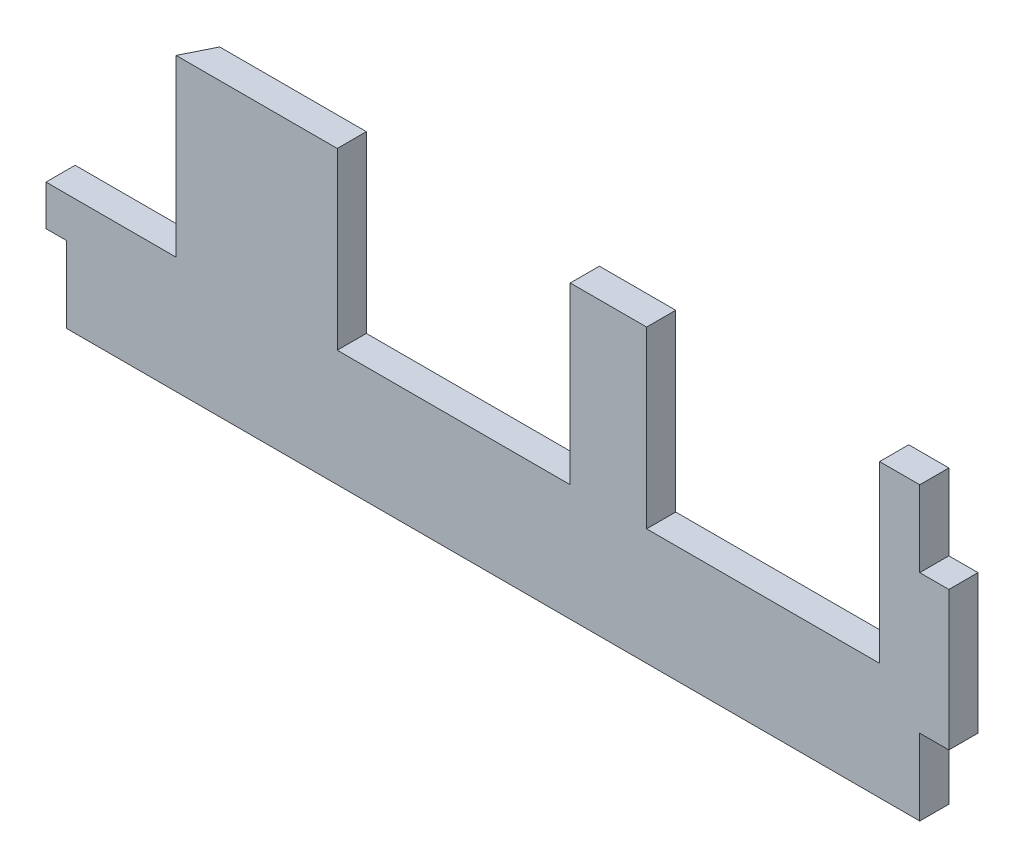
ISO-10303-21;
HEADER;
FILE_DESCRIPTION(('STEP AP214'),'2;1');
FILE_NAME('part.step','',(''),(''),'','','');
FILE_SCHEMA(('AUTOMOTIVE_DESIGN { 1 0 10303 214 1 1 1 1 }'));
ENDSEC;
DATA;
#1=APPLICATION_CONTEXT('core data for automotive mechanical design processes');
#2=APPLICATION_PROTOCOL_DEFINITION('international standard','automotive_design',2000,#1);
#3=PRODUCT_CONTEXT('',#1,'mechanical');
#4=PRODUCT('Part','Part','',(#3));
#5=PRODUCT_RELATED_PRODUCT_CATEGORY('part','',(#4));
#6=PRODUCT_DEFINITION_FORMATION('','',#4);
#7=PRODUCT_DEFINITION_CONTEXT('part definition',#1,'design');
#8=PRODUCT_DEFINITION('design','',#6,#7);
#9=PRODUCT_DEFINITION_SHAPE('','',#8);
#10=(LENGTH_UNIT() NAMED_UNIT(*) SI_UNIT(.MILLI.,.METRE.));
#11=(NAMED_UNIT(*) PLANE_ANGLE_UNIT() SI_UNIT($,.RADIAN.));
#12=(NAMED_UNIT(*) SI_UNIT($,.STERADIAN.) SOLID_ANGLE_UNIT());
#13=UNCERTAINTY_MEASURE_WITH_UNIT(LENGTH_MEASURE(1.E-05),#10,'distance_accuracy_value','');
#14=(GEOMETRIC_REPRESENTATION_CONTEXT(3) GLOBAL_UNCERTAINTY_ASSIGNED_CONTEXT((#13)) GLOBAL_UNIT_ASSIGNED_CONTEXT((#10,
#11,#12)) REPRESENTATION_CONTEXT('',''));
#15=CARTESIAN_POINT('',(0.,0.,0.));
#16=DIRECTION('',(0.,0.,1.));
#17=DIRECTION('',(1.,0.,0.));
#18=AXIS2_PLACEMENT_3D('',#15,#16,#17);
#19=CARTESIAN_POINT('',(-409.754754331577,131.379168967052,-12.7));
#20=DIRECTION('',(-1.,0.,0.));
#21=DIRECTION('',(0.,0.,1.));
#22=AXIS2_PLACEMENT_3D('',#19,#20,#21);
#23=PLANE('',#22);
#24=DIRECTION('',(0.,-1.,0.));
#25=VECTOR('',#24,1.);
#26=CARTESIAN_POINT('',(-409.754754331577,131.379168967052,0.));
#27=LINE('',#26,#25);
#28=CARTESIAN_POINT('',(-409.754754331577,148.988624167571,0.));
#29=VERTEX_POINT('',#28);
#30=CARTESIAN_POINT('',(-409.754754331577,131.379168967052,0.));
#31=VERTEX_POINT('',#30);
#32=EDGE_CURVE('E183',#29,#31,#27,.T.);
#33=ORIENTED_EDGE('',*,*,#32,.F.);
#34=DIRECTION('',(0.,0.,1.));
#35=VECTOR('',#34,1.);
#36=CARTESIAN_POINT('',(-409.754754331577,148.988624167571,-12.7));
#37=LINE('',#36,#35);
#38=CARTESIAN_POINT('',(-409.754754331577,148.988624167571,-12.7));
#39=VERTEX_POINT('',#38);
#40=EDGE_CURVE('E48',#39,#29,#37,.T.);
#41=ORIENTED_EDGE('',*,*,#40,.F.);
#42=DIRECTION('',(0.,-1.,0.));
#43=VECTOR('',#42,1.);
#44=CARTESIAN_POINT('',(-409.754754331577,131.379168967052,-12.7));
#45=LINE('',#44,#43);
#46=CARTESIAN_POINT('',(-409.754754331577,131.379168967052,-12.7));
#47=VERTEX_POINT('',#46);
#48=EDGE_CURVE('E181',#39,#47,#45,.T.);
#49=ORIENTED_EDGE('',*,*,#48,.T.);
#50=DIRECTION('',(0.,0.,1.));
#51=VECTOR('',#50,1.);
#52=CARTESIAN_POINT('',(-409.754754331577,131.379168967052,-12.7));
#53=LINE('',#52,#51);
#54=EDGE_CURVE('E246',#47,#31,#53,.T.);
#55=ORIENTED_EDGE('',*,*,#54,.T.);
#56=EDGE_LOOP('',(#33,#41,#49,#55));
#57=FACE_BOUND('',#56,.T.);
#58=ADVANCED_FACE('F31',(#57),#23,.T.);
#59=CARTESIAN_POINT('',(-409.754754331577,225.188624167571,-12.7));
#60=DIRECTION('',(0.,1.,0.));
#61=DIRECTION('',(-1.,0.,0.));
#62=AXIS2_PLACEMENT_3D('',#59,#60,#61);
#63=PLANE('',#62);
#64=DIRECTION('',(0.,0.,1.));
#65=VECTOR('',#64,1.);
#66=CARTESIAN_POINT('',(-147.863985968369,225.18862416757,-12.7));
#67=LINE('',#66,#65);
#68=CARTESIAN_POINT('',(-147.863985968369,225.18862416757,-12.7));
#69=VERTEX_POINT('',#68);
#70=CARTESIAN_POINT('',(-147.863985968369,225.18862416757,0.));
#71=VERTEX_POINT('',#70);
#72=EDGE_CURVE('E298',#69,#71,#67,.T.);
#73=ORIENTED_EDGE('',*,*,#72,.F.);
#74=DIRECTION('',(-1.,0.,0.));
#75=VECTOR('',#74,1.);
#76=CARTESIAN_POINT('',(-409.754754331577,225.188624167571,-12.7));
#77=LINE('',#76,#75);
#78=CARTESIAN_POINT('',(-181.154754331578,225.18862416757,-12.7));
#79=VERTEX_POINT('',#78);
#80=EDGE_CURVE('E196',#69,#79,#77,.T.);
#81=ORIENTED_EDGE('',*,*,#80,.T.);
#82=DIRECTION('',(0.,0.,-1.));
#83=VECTOR('',#82,1.);
#84=CARTESIAN_POINT('',(-181.154754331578,225.18862416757,-12.7));
#85=LINE('',#84,#83);
#86=CARTESIAN_POINT('',(-181.154754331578,225.18862416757,0.));
#87=VERTEX_POINT('',#86);
#88=EDGE_CURVE('E297',#87,#79,#85,.T.);
#89=ORIENTED_EDGE('',*,*,#88,.F.);
#90=DIRECTION('',(-1.,0.,0.));
#91=VECTOR('',#90,1.);
#92=CARTESIAN_POINT('',(-409.754754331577,225.188624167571,0.));
#93=LINE('',#92,#91);
#94=EDGE_CURVE('E226',#71,#87,#93,.T.);
#95=ORIENTED_EDGE('',*,*,#94,.F.);
#96=EDGE_LOOP('',(#73,#81,#89,#95));
#97=FACE_BOUND('',#96,.T.);
#98=ADVANCED_FACE('F295',(#97),#63,.T.);
#99=DIRECTION('',(0.44510351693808,0.,-0.895479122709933));
#100=VECTOR('',#99,1.);
#101=CARTESIAN_POINT('',(-353.025346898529,225.188624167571,0.));
#102=LINE('',#101,#100);
#103=CARTESIAN_POINT('',(-353.025346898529,225.188624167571,0.));
#104=VERTEX_POINT('',#103);
#105=CARTESIAN_POINT('',(-346.712732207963,225.188624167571,-12.7));
#106=VERTEX_POINT('',#105);
#107=EDGE_CURVE('E176',#104,#106,#102,.T.);
#108=ORIENTED_EDGE('',*,*,#107,.F.);
#109=CARTESIAN_POINT('',(-282.754754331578,225.188624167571,0.));
#110=VERTEX_POINT('',#109);
#111=EDGE_CURVE('E222',#110,#104,#93,.T.);
#112=ORIENTED_EDGE('',*,*,#111,.F.);
#113=DIRECTION('',(0.,0.,1.));
#114=VECTOR('',#113,1.);
#115=CARTESIAN_POINT('',(-282.754754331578,225.188624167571,-12.7));
#116=LINE('',#115,#114);
#117=CARTESIAN_POINT('',(-282.754754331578,225.188624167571,-12.7));
#118=VERTEX_POINT('',#117);
#119=EDGE_CURVE('E309',#118,#110,#116,.T.);
#120=ORIENTED_EDGE('',*,*,#119,.F.);
#121=EDGE_CURVE('E198',#118,#106,#77,.T.);
#122=ORIENTED_EDGE('',*,*,#121,.T.);
#123=EDGE_LOOP('',(#108,#112,#120,#122));
#124=FACE_BOUND('',#123,.T.);
#125=ADVANCED_FACE('F389',(#124),#63,.T.);
#126=CARTESIAN_POINT('',(-16.0547543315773,131.379168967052,-12.7));
#127=DIRECTION('',(0.,-1.,0.));
#128=DIRECTION('',(0.,0.,-1.));
#129=AXIS2_PLACEMENT_3D('',#126,#127,#128);
#130=PLANE('',#129);
#131=DIRECTION('',(1.,0.,0.));
#132=VECTOR('',#131,1.);
#133=CARTESIAN_POINT('',(-16.0547543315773,131.379168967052,0.));
#134=LINE('',#133,#132);
#135=CARTESIAN_POINT('',(-28.7547543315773,131.379168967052,0.));
#136=VERTEX_POINT('',#135);
#137=CARTESIAN_POINT('',(-16.0547543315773,131.379168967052,0.));
#138=VERTEX_POINT('',#137);
#139=EDGE_CURVE('E209',#136,#138,#134,.T.);
#140=ORIENTED_EDGE('',*,*,#139,.F.);
#141=DIRECTION('',(0.,0.,1.));
#142=VECTOR('',#141,1.);
#143=CARTESIAN_POINT('',(-28.7547543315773,131.379168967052,-12.7));
#144=LINE('',#143,#142);
#145=CARTESIAN_POINT('',(-28.7547543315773,131.379168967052,-12.7));
#146=VERTEX_POINT('',#145);
#147=EDGE_CURVE('E11',#146,#136,#144,.T.);
#148=ORIENTED_EDGE('',*,*,#147,.F.);
#149=DIRECTION('',(1.,0.,0.));
#150=VECTOR('',#149,1.);
#151=CARTESIAN_POINT('',(-16.0547543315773,131.379168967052,-12.7));
#152=LINE('',#151,#150);
#153=CARTESIAN_POINT('',(-16.0547543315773,131.379168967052,-12.7));
#154=VERTEX_POINT('',#153);
#155=EDGE_CURVE('E239',#146,#154,#152,.T.);
#156=ORIENTED_EDGE('',*,*,#155,.T.);
#157=DIRECTION('',(0.,0.,1.));
#158=VECTOR('',#157,1.);
#159=CARTESIAN_POINT('',(-16.0547543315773,131.379168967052,-12.7));
#160=LINE('',#159,#158);
#161=EDGE_CURVE('E35',#154,#138,#160,.T.);
#162=ORIENTED_EDGE('',*,*,#161,.T.);
#163=EDGE_LOOP('',(#140,#148,#156,#162));
#164=FACE_BOUND('',#163,.T.);
#165=ADVANCED_FACE('F33',(#164),#130,.T.);
#166=CARTESIAN_POINT('',(-28.7547543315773,131.379168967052,-12.7));
#167=DIRECTION('',(1.,0.,0.));
#168=DIRECTION('',(0.,0.,-1.));
#169=AXIS2_PLACEMENT_3D('',#166,#167,#168);
#170=PLANE('',#169);
#171=DIRECTION('',(0.,1.,0.));
#172=VECTOR('',#171,1.);
#173=CARTESIAN_POINT('',(-28.7547543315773,131.379168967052,0.));
#174=LINE('',#173,#172);
#175=CARTESIAN_POINT('',(-28.7547543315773,98.1886241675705,0.));
#176=VERTEX_POINT('',#175);
#177=EDGE_CURVE('E237',#176,#136,#174,.T.);
#178=ORIENTED_EDGE('',*,*,#177,.F.);
#179=DIRECTION('',(0.,0.,1.));
#180=VECTOR('',#179,1.);
#181=CARTESIAN_POINT('',(-28.7547543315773,98.1886241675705,-12.7));
#182=LINE('',#181,#180);
#183=CARTESIAN_POINT('',(-28.7547543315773,98.1886241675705,-12.7));
#184=VERTEX_POINT('',#183);
#185=EDGE_CURVE('E40',#184,#176,#182,.T.);
#186=ORIENTED_EDGE('',*,*,#185,.F.);
#187=DIRECTION('',(0.,1.,0.));
#188=VECTOR('',#187,1.);
#189=CARTESIAN_POINT('',(-28.7547543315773,131.379168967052,-12.7));
#190=LINE('',#189,#188);
#191=EDGE_CURVE('E206',#184,#146,#190,.T.);
#192=ORIENTED_EDGE('',*,*,#191,.T.);
#193=ORIENTED_EDGE('',*,*,#147,.T.);
#194=EDGE_LOOP('',(#178,#186,#192,#193));
#195=FACE_BOUND('',#194,.T.);
#196=ADVANCED_FACE('F268',(#195),#170,.T.);
#197=CARTESIAN_POINT('',(-400.774498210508,98.1886241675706,-12.7));
#198=DIRECTION('',(0.,-1.,0.));
#199=DIRECTION('',(1.,0.,0.));
#200=AXIS2_PLACEMENT_3D('',#197,#198,#199);
#201=PLANE('',#200);
#202=DIRECTION('',(1.,0.,0.));
#203=VECTOR('',#202,1.);
#204=CARTESIAN_POINT('',(-400.774498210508,98.1886241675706,0.));
#205=LINE('',#204,#203);
#206=CARTESIAN_POINT('',(-400.774498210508,98.1886241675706,0.));
#207=VERTEX_POINT('',#206);
#208=EDGE_CURVE('E234',#207,#176,#205,.T.);
#209=ORIENTED_EDGE('',*,*,#208,.F.);
#210=DIRECTION('',(0.,0.,1.));
#211=VECTOR('',#210,1.);
#212=CARTESIAN_POINT('',(-400.774498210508,98.1886241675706,-12.7));
#213=LINE('',#212,#211);
#214=CARTESIAN_POINT('',(-400.774498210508,98.1886241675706,-12.7));
#215=VERTEX_POINT('',#214);
#216=EDGE_CURVE('E242',#215,#207,#213,.T.);
#217=ORIENTED_EDGE('',*,*,#216,.F.);
#218=DIRECTION('',(1.,0.,0.));
#219=VECTOR('',#218,1.);
#220=CARTESIAN_POINT('',(-400.774498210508,98.1886241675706,-12.7));
#221=LINE('',#220,#219);
#222=EDGE_CURVE('E203',#215,#184,#221,.T.);
#223=ORIENTED_EDGE('',*,*,#222,.T.);
#224=ORIENTED_EDGE('',*,*,#185,.T.);
#225=EDGE_LOOP('',(#209,#217,#223,#224));
#226=FACE_BOUND('',#225,.T.);
#227=ADVANCED_FACE('F426',(#226),#201,.T.);
#228=CARTESIAN_POINT('',(-400.774498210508,98.1886241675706,-12.7));
#229=DIRECTION('',(-1.,0.,0.));
#230=DIRECTION('',(0.,0.,1.));
#231=AXIS2_PLACEMENT_3D('',#228,#229,#230);
#232=PLANE('',#231);
#233=DIRECTION('',(0.,-1.,0.));
#234=VECTOR('',#233,1.);
#235=CARTESIAN_POINT('',(-400.774498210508,98.1886241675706,0.));
#236=LINE('',#235,#234);
#237=CARTESIAN_POINT('',(-400.774498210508,131.379168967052,0.));
#238=VERTEX_POINT('',#237);
#239=EDGE_CURVE('E231',#238,#207,#236,.T.);
#240=ORIENTED_EDGE('',*,*,#239,.F.);
#241=DIRECTION('',(0.,0.,1.));
#242=VECTOR('',#241,1.);
#243=CARTESIAN_POINT('',(-400.774498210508,131.379168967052,-12.7));
#244=LINE('',#243,#242);
#245=CARTESIAN_POINT('',(-400.774498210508,131.379168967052,-12.7));
#246=VERTEX_POINT('',#245);
#247=EDGE_CURVE('E244',#246,#238,#244,.T.);
#248=ORIENTED_EDGE('',*,*,#247,.F.);
#249=DIRECTION('',(0.,-1.,0.));
#250=VECTOR('',#249,1.);
#251=CARTESIAN_POINT('',(-400.774498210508,98.1886241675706,-12.7));
#252=LINE('',#251,#250);
#253=EDGE_CURVE('E193',#246,#215,#252,.T.);
#254=ORIENTED_EDGE('',*,*,#253,.T.);
#255=ORIENTED_EDGE('',*,*,#216,.T.);
#256=EDGE_LOOP('',(#240,#248,#254,#255));
#257=FACE_BOUND('',#256,.T.);
#258=ADVANCED_FACE('F398',(#257),#232,.T.);
#259=CARTESIAN_POINT('',(-400.774498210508,131.379168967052,-12.7));
#260=DIRECTION('',(0.,-1.,0.));
#261=DIRECTION('',(0.,0.,-1.));
#262=AXIS2_PLACEMENT_3D('',#259,#260,#261);
#263=PLANE('',#262);
#264=DIRECTION('',(1.,0.,0.));
#265=VECTOR('',#264,1.);
#266=CARTESIAN_POINT('',(-400.774498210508,131.379168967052,0.));
#267=LINE('',#266,#265);
#268=EDGE_CURVE('E228',#31,#238,#267,.T.);
#269=ORIENTED_EDGE('',*,*,#268,.F.);
#270=ORIENTED_EDGE('',*,*,#54,.F.);
#271=DIRECTION('',(1.,0.,0.));
#272=VECTOR('',#271,1.);
#273=CARTESIAN_POINT('',(-400.774498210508,131.379168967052,-12.7));
#274=LINE('',#273,#272);
#275=EDGE_CURVE('E190',#47,#246,#274,.T.);
#276=ORIENTED_EDGE('',*,*,#275,.T.);
#277=ORIENTED_EDGE('',*,*,#247,.T.);
#278=EDGE_LOOP('',(#269,#270,#276,#277));
#279=FACE_BOUND('',#278,.T.);
#280=ADVANCED_FACE('F392',(#279),#263,.T.);
#281=DIRECTION('',(0.,0.,-1.));
#282=VECTOR('',#281,1.);
#283=CARTESIAN_POINT('',(-46.2639859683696,225.18862416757,-12.7));
#284=LINE('',#283,#282);
#285=CARTESIAN_POINT('',(-46.2639859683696,225.18862416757,0.));
#286=VERTEX_POINT('',#285);
#287=CARTESIAN_POINT('',(-46.2639859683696,225.18862416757,-12.7));
#288=VERTEX_POINT('',#287);
#289=EDGE_CURVE('E337',#286,#288,#284,.T.);
#290=ORIENTED_EDGE('',*,*,#289,.F.);
#291=CARTESIAN_POINT('',(-28.7547543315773,225.18862416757,0.));
#292=VERTEX_POINT('',#291);
#293=EDGE_CURVE('E223',#292,#286,#93,.T.);
#294=ORIENTED_EDGE('',*,*,#293,.F.);
#295=DIRECTION('',(0.,0.,1.));
#296=VECTOR('',#295,1.);
#297=CARTESIAN_POINT('',(-28.7547543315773,225.18862416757,-12.7));
#298=LINE('',#297,#296);
#299=CARTESIAN_POINT('',(-28.7547543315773,225.18862416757,-12.7));
#300=VERTEX_POINT('',#299);
#301=EDGE_CURVE('E248',#300,#292,#298,.T.);
#302=ORIENTED_EDGE('',*,*,#301,.F.);
#303=EDGE_CURVE('E191',#300,#288,#77,.T.);
#304=ORIENTED_EDGE('',*,*,#303,.T.);
#305=EDGE_LOOP('',(#290,#294,#302,#304));
#306=FACE_BOUND('',#305,.T.);
#307=ADVANCED_FACE('F372',(#306),#63,.T.);
#308=CARTESIAN_POINT('',(-28.7547543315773,225.18862416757,-12.7));
#309=DIRECTION('',(1.,0.,0.));
#310=DIRECTION('',(0.,0.,-1.));
#311=AXIS2_PLACEMENT_3D('',#308,#309,#310);
#312=PLANE('',#311);
#313=DIRECTION('',(0.,1.,0.));
#314=VECTOR('',#313,1.);
#315=CARTESIAN_POINT('',(-28.7547543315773,225.18862416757,0.));
#316=LINE('',#315,#314);
#317=CARTESIAN_POINT('',(-28.7547543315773,191.998079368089,0.));
#318=VERTEX_POINT('',#317);
#319=EDGE_CURVE('E219',#318,#292,#316,.T.);
#320=ORIENTED_EDGE('',*,*,#319,.F.);
#321=DIRECTION('',(0.,0.,1.));
#322=VECTOR('',#321,1.);
#323=CARTESIAN_POINT('',(-28.7547543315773,191.998079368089,-12.7));
#324=LINE('',#323,#322);
#325=CARTESIAN_POINT('',(-28.7547543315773,191.998079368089,-12.7));
#326=VERTEX_POINT('',#325);
#327=EDGE_CURVE('E250',#326,#318,#324,.T.);
#328=ORIENTED_EDGE('',*,*,#327,.F.);
#329=DIRECTION('',(0.,1.,0.));
#330=VECTOR('',#329,1.);
#331=CARTESIAN_POINT('',(-28.7547543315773,225.18862416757,-12.7));
#332=LINE('',#331,#330);
#333=EDGE_CURVE('E281',#326,#300,#332,.T.);
#334=ORIENTED_EDGE('',*,*,#333,.T.);
#335=ORIENTED_EDGE('',*,*,#301,.T.);
#336=EDGE_LOOP('',(#320,#328,#334,#335));
#337=FACE_BOUND('',#336,.T.);
#338=ADVANCED_FACE('F374',(#337),#312,.T.);
#339=CARTESIAN_POINT('',(-16.0547543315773,191.998079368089,-12.7));
#340=DIRECTION('',(0.,1.,0.));
#341=DIRECTION('',(0.,0.,1.));
#342=AXIS2_PLACEMENT_3D('',#339,#340,#341);
#343=PLANE('',#342);
#344=DIRECTION('',(-1.,0.,0.));
#345=VECTOR('',#344,1.);
#346=CARTESIAN_POINT('',(-16.0547543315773,191.998079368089,0.));
#347=LINE('',#346,#345);
#348=CARTESIAN_POINT('',(-16.0547543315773,191.998079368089,0.));
#349=VERTEX_POINT('',#348);
#350=EDGE_CURVE('E216',#349,#318,#347,.T.);
#351=ORIENTED_EDGE('',*,*,#350,.F.);
#352=DIRECTION('',(0.,0.,1.));
#353=VECTOR('',#352,1.);
#354=CARTESIAN_POINT('',(-16.0547543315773,191.998079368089,-12.7));
#355=LINE('',#354,#353);
#356=CARTESIAN_POINT('',(-16.0547543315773,191.998079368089,-12.7));
#357=VERTEX_POINT('',#356);
#358=EDGE_CURVE('E251',#357,#349,#355,.T.);
#359=ORIENTED_EDGE('',*,*,#358,.F.);
#360=DIRECTION('',(-1.,0.,0.));
#361=VECTOR('',#360,1.);
#362=CARTESIAN_POINT('',(-16.0547543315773,191.998079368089,-12.7));
#363=LINE('',#362,#361);
#364=EDGE_CURVE('E274',#357,#326,#363,.T.);
#365=ORIENTED_EDGE('',*,*,#364,.T.);
#366=ORIENTED_EDGE('',*,*,#327,.T.);
#367=EDGE_LOOP('',(#351,#359,#365,#366));
#368=FACE_BOUND('',#367,.T.);
#369=ADVANCED_FACE('F376',(#368),#343,.T.);
#370=CARTESIAN_POINT('',(-16.0547543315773,191.998079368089,-12.7));
#371=DIRECTION('',(1.,0.,0.));
#372=DIRECTION('',(0.,0.,-1.));
#373=AXIS2_PLACEMENT_3D('',#370,#371,#372);
#374=PLANE('',#373);
#375=DIRECTION('',(0.,1.,0.));
#376=VECTOR('',#375,1.);
#377=CARTESIAN_POINT('',(-16.0547543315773,191.998079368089,0.));
#378=LINE('',#377,#376);
#379=EDGE_CURVE('E212',#138,#349,#378,.T.);
#380=ORIENTED_EDGE('',*,*,#379,.F.);
#381=ORIENTED_EDGE('',*,*,#161,.F.);
#382=DIRECTION('',(0.,1.,0.));
#383=VECTOR('',#382,1.);
#384=CARTESIAN_POINT('',(-16.0547543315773,191.998079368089,-12.7));
#385=LINE('',#384,#383);
#386=EDGE_CURVE('E272',#154,#357,#385,.T.);
#387=ORIENTED_EDGE('',*,*,#386,.T.);
#388=ORIENTED_EDGE('',*,*,#358,.T.);
#389=EDGE_LOOP('',(#380,#381,#387,#388));
#390=FACE_BOUND('',#389,.T.);
#391=ADVANCED_FACE('F261',(#390),#374,.T.);
#392=CARTESIAN_POINT('',(-28.7547543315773,131.379168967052,-12.7));
#393=DIRECTION('',(0.,0.,1.));
#394=DIRECTION('',(1.,0.,0.));
#395=AXIS2_PLACEMENT_3D('',#392,#393,#394);
#396=PLANE('',#395);
#397=DIRECTION('',(-1.,0.,0.));
#398=VECTOR('',#397,1.);
#399=CARTESIAN_POINT('',(-346.712732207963,148.988624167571,-12.7));
#400=LINE('',#399,#398);
#401=CARTESIAN_POINT('',(-346.712732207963,148.988624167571,-12.7));
#402=VERTEX_POINT('',#401);
#403=EDGE_CURVE('E169',#402,#39,#400,.T.);
#404=ORIENTED_EDGE('',*,*,#403,.F.);
#405=DIRECTION('',(0.,1.,0.));
#406=VECTOR('',#405,1.);
#407=CARTESIAN_POINT('',(-346.712732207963,148.988624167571,-12.7));
#408=LINE('',#407,#406);
#409=EDGE_CURVE('E340',#402,#106,#408,.T.);
#410=ORIENTED_EDGE('',*,*,#409,.T.);
#411=ORIENTED_EDGE('',*,*,#121,.F.);
#412=DIRECTION('',(0.,1.,0.));
#413=VECTOR('',#412,1.);
#414=CARTESIAN_POINT('',(-282.754754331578,148.988624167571,-12.7));
#415=LINE('',#414,#413);
#416=CARTESIAN_POINT('',(-282.754754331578,148.988624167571,-12.7));
#417=VERTEX_POINT('',#416);
#418=EDGE_CURVE('E213',#417,#118,#415,.T.);
#419=ORIENTED_EDGE('',*,*,#418,.F.);
#420=DIRECTION('',(-1.,0.,0.));
#421=VECTOR('',#420,1.);
#422=CARTESIAN_POINT('',(-282.754754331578,148.988624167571,-12.7));
#423=LINE('',#422,#421);
#424=CARTESIAN_POINT('',(-181.154754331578,148.98862416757,-12.7));
#425=VERTEX_POINT('',#424);
#426=EDGE_CURVE('E314',#425,#417,#423,.T.);
#427=ORIENTED_EDGE('',*,*,#426,.F.);
#428=DIRECTION('',(0.,1.,0.));
#429=VECTOR('',#428,1.);
#430=CARTESIAN_POINT('',(-181.154754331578,148.98862416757,-12.7));
#431=LINE('',#430,#429);
#432=EDGE_CURVE('E304',#425,#79,#431,.T.);
#433=ORIENTED_EDGE('',*,*,#432,.T.);
#434=ORIENTED_EDGE('',*,*,#80,.F.);
#435=DIRECTION('',(0.,1.,0.));
#436=VECTOR('',#435,1.);
#437=CARTESIAN_POINT('',(-147.863985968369,148.98862416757,-12.7));
#438=LINE('',#437,#436);
#439=CARTESIAN_POINT('',(-147.863985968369,148.98862416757,-12.7));
#440=VERTEX_POINT('',#439);
#441=EDGE_CURVE('E319',#440,#69,#438,.T.);
#442=ORIENTED_EDGE('',*,*,#441,.F.);
#443=DIRECTION('',(-1.,0.,0.));
#444=VECTOR('',#443,1.);
#445=CARTESIAN_POINT('',(-147.863985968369,148.98862416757,-12.7));
#446=LINE('',#445,#444);
#447=CARTESIAN_POINT('',(-46.2639859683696,148.98862416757,-12.7));
#448=VERTEX_POINT('',#447);
#449=EDGE_CURVE('E331',#448,#440,#446,.T.);
#450=ORIENTED_EDGE('',*,*,#449,.F.);
#451=DIRECTION('',(0.,1.,0.));
#452=VECTOR('',#451,1.);
#453=CARTESIAN_POINT('',(-46.2639859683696,148.98862416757,-12.7));
#454=LINE('',#453,#452);
#455=EDGE_CURVE('E333',#448,#288,#454,.T.);
#456=ORIENTED_EDGE('',*,*,#455,.T.);
#457=ORIENTED_EDGE('',*,*,#303,.F.);
#458=ORIENTED_EDGE('',*,*,#333,.F.);
#459=ORIENTED_EDGE('',*,*,#364,.F.);
#460=ORIENTED_EDGE('',*,*,#386,.F.);
#461=ORIENTED_EDGE('',*,*,#155,.F.);
#462=ORIENTED_EDGE('',*,*,#191,.F.);
#463=ORIENTED_EDGE('',*,*,#222,.F.);
#464=ORIENTED_EDGE('',*,*,#253,.F.);
#465=ORIENTED_EDGE('',*,*,#275,.F.);
#466=ORIENTED_EDGE('',*,*,#48,.F.);
#467=EDGE_LOOP('',(#404,#410,#411,#419,#427,#433,#434,#442,#450,#456,#457,#458,#459,#460,#461,
#462,#463,#464,#465,#466));
#468=FACE_BOUND('',#467,.T.);
#469=ADVANCED_FACE('F187',(#468),#396,.F.);
#470=CARTESIAN_POINT('',(-28.7547543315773,131.379168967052,0.));
#471=DIRECTION('',(0.,0.,1.));
#472=DIRECTION('',(1.,0.,0.));
#473=AXIS2_PLACEMENT_3D('',#470,#471,#472);
#474=PLANE('',#473);
#475=DIRECTION('',(0.,1.,0.));
#476=VECTOR('',#475,1.);
#477=CARTESIAN_POINT('',(-353.025346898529,148.988624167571,0.));
#478=LINE('',#477,#476);
#479=CARTESIAN_POINT('',(-353.025346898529,148.988624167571,0.));
#480=VERTEX_POINT('',#479);
#481=EDGE_CURVE('E348',#480,#104,#478,.T.);
#482=ORIENTED_EDGE('',*,*,#481,.F.);
#483=DIRECTION('',(1.,0.,0.));
#484=VECTOR('',#483,1.);
#485=CARTESIAN_POINT('',(-409.754754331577,148.988624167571,0.));
#486=LINE('',#485,#484);
#487=EDGE_CURVE('E184',#29,#480,#486,.T.);
#488=ORIENTED_EDGE('',*,*,#487,.F.);
#489=ORIENTED_EDGE('',*,*,#32,.T.);
#490=ORIENTED_EDGE('',*,*,#268,.T.);
#491=ORIENTED_EDGE('',*,*,#239,.T.);
#492=ORIENTED_EDGE('',*,*,#208,.T.);
#493=ORIENTED_EDGE('',*,*,#177,.T.);
#494=ORIENTED_EDGE('',*,*,#139,.T.);
#495=ORIENTED_EDGE('',*,*,#379,.T.);
#496=ORIENTED_EDGE('',*,*,#350,.T.);
#497=ORIENTED_EDGE('',*,*,#319,.T.);
#498=ORIENTED_EDGE('',*,*,#293,.T.);
#499=DIRECTION('',(0.,1.,0.));
#500=VECTOR('',#499,1.);
#501=CARTESIAN_POINT('',(-46.2639859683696,148.98862416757,0.));
#502=LINE('',#501,#500);
#503=CARTESIAN_POINT('',(-46.2639859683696,148.98862416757,0.));
#504=VERTEX_POINT('',#503);
#505=EDGE_CURVE('E330',#504,#286,#502,.T.);
#506=ORIENTED_EDGE('',*,*,#505,.F.);
#507=DIRECTION('',(1.,0.,0.));
#508=VECTOR('',#507,1.);
#509=CARTESIAN_POINT('',(-147.863985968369,148.98862416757,0.));
#510=LINE('',#509,#508);
#511=CARTESIAN_POINT('',(-147.863985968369,148.98862416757,0.));
#512=VERTEX_POINT('',#511);
#513=EDGE_CURVE('E345',#512,#504,#510,.T.);
#514=ORIENTED_EDGE('',*,*,#513,.F.);
#515=DIRECTION('',(0.,1.,0.));
#516=VECTOR('',#515,1.);
#517=CARTESIAN_POINT('',(-147.863985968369,148.98862416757,0.));
#518=LINE('',#517,#516);
#519=EDGE_CURVE('E327',#512,#71,#518,.T.);
#520=ORIENTED_EDGE('',*,*,#519,.T.);
#521=ORIENTED_EDGE('',*,*,#94,.T.);
#522=DIRECTION('',(0.,1.,0.));
#523=VECTOR('',#522,1.);
#524=CARTESIAN_POINT('',(-181.154754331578,148.98862416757,0.));
#525=LINE('',#524,#523);
#526=CARTESIAN_POINT('',(-181.154754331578,148.98862416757,0.));
#527=VERTEX_POINT('',#526);
#528=EDGE_CURVE('E307',#527,#87,#525,.T.);
#529=ORIENTED_EDGE('',*,*,#528,.F.);
#530=DIRECTION('',(1.,0.,0.));
#531=VECTOR('',#530,1.);
#532=CARTESIAN_POINT('',(-282.754754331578,148.988624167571,0.));
#533=LINE('',#532,#531);
#534=CARTESIAN_POINT('',(-282.754754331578,148.988624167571,0.));
#535=VERTEX_POINT('',#534);
#536=EDGE_CURVE('E323',#535,#527,#533,.T.);
#537=ORIENTED_EDGE('',*,*,#536,.F.);
#538=DIRECTION('',(0.,1.,0.));
#539=VECTOR('',#538,1.);
#540=CARTESIAN_POINT('',(-282.754754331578,148.988624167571,0.));
#541=LINE('',#540,#539);
#542=EDGE_CURVE('E277',#535,#110,#541,.T.);
#543=ORIENTED_EDGE('',*,*,#542,.T.);
#544=ORIENTED_EDGE('',*,*,#111,.T.);
#545=EDGE_LOOP('',(#482,#488,#489,#490,#491,#492,#493,#494,#495,#496,#497,#498,#506,#514,#520,
#521,#529,#537,#543,#544));
#546=FACE_BOUND('',#545,.T.);
#547=ADVANCED_FACE('F264',(#546),#474,.T.);
#548=CARTESIAN_POINT('',(-282.754754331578,148.988624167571,-12.7));
#549=DIRECTION('',(-1.,0.,0.));
#550=DIRECTION('',(0.,-1.,0.));
#551=AXIS2_PLACEMENT_3D('',#548,#549,#550);
#552=PLANE('',#551);
#553=ORIENTED_EDGE('',*,*,#119,.T.);
#554=ORIENTED_EDGE('',*,*,#542,.F.);
#555=DIRECTION('',(0.,0.,1.));
#556=VECTOR('',#555,1.);
#557=CARTESIAN_POINT('',(-282.754754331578,148.988624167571,-12.7));
#558=LINE('',#557,#556);
#559=EDGE_CURVE('E308',#417,#535,#558,.T.);
#560=ORIENTED_EDGE('',*,*,#559,.F.);
#561=ORIENTED_EDGE('',*,*,#418,.T.);
#562=EDGE_LOOP('',(#553,#554,#560,#561));
#563=FACE_BOUND('',#562,.T.);
#564=ADVANCED_FACE('F405',(#563),#552,.F.);
#565=CARTESIAN_POINT('',(-181.154754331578,148.98862416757,-12.7));
#566=DIRECTION('',(1.,0.,0.));
#567=DIRECTION('',(0.,1.,0.));
#568=AXIS2_PLACEMENT_3D('',#565,#566,#567);
#569=PLANE('',#568);
#570=ORIENTED_EDGE('',*,*,#88,.T.);
#571=ORIENTED_EDGE('',*,*,#432,.F.);
#572=DIRECTION('',(0.,0.,-1.));
#573=VECTOR('',#572,1.);
#574=CARTESIAN_POINT('',(-181.154754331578,148.98862416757,-12.7));
#575=LINE('',#574,#573);
#576=EDGE_CURVE('E321',#527,#425,#575,.T.);
#577=ORIENTED_EDGE('',*,*,#576,.F.);
#578=ORIENTED_EDGE('',*,*,#528,.T.);
#579=EDGE_LOOP('',(#570,#571,#577,#578));
#580=FACE_BOUND('',#579,.T.);
#581=ADVANCED_FACE('F303',(#580),#569,.F.);
#582=CARTESIAN_POINT('',(-282.754754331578,148.988624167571,0.));
#583=DIRECTION('',(0.,1.,0.));
#584=DIRECTION('',(-1.,0.,0.));
#585=AXIS2_PLACEMENT_3D('',#582,#583,#584);
#586=PLANE('',#585);
#587=ORIENTED_EDGE('',*,*,#559,.T.);
#588=ORIENTED_EDGE('',*,*,#536,.T.);
#589=ORIENTED_EDGE('',*,*,#576,.T.);
#590=ORIENTED_EDGE('',*,*,#426,.T.);
#591=EDGE_LOOP('',(#587,#588,#589,#590));
#592=FACE_BOUND('',#591,.T.);
#593=ADVANCED_FACE('F407',(#592),#586,.T.);
#594=CARTESIAN_POINT('',(-147.863985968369,148.98862416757,-12.7));
#595=DIRECTION('',(-1.,0.,0.));
#596=DIRECTION('',(0.,-1.,0.));
#597=AXIS2_PLACEMENT_3D('',#594,#595,#596);
#598=PLANE('',#597);
#599=ORIENTED_EDGE('',*,*,#72,.T.);
#600=ORIENTED_EDGE('',*,*,#519,.F.);
#601=DIRECTION('',(0.,0.,1.));
#602=VECTOR('',#601,1.);
#603=CARTESIAN_POINT('',(-147.863985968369,148.98862416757,-12.7));
#604=LINE('',#603,#602);
#605=EDGE_CURVE('E56',#440,#512,#604,.T.);
#606=ORIENTED_EDGE('',*,*,#605,.F.);
#607=ORIENTED_EDGE('',*,*,#441,.T.);
#608=EDGE_LOOP('',(#599,#600,#606,#607));
#609=FACE_BOUND('',#608,.T.);
#610=ADVANCED_FACE('F363',(#609),#598,.F.);
#611=CARTESIAN_POINT('',(-46.2639859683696,148.98862416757,-12.7));
#612=DIRECTION('',(1.,0.,0.));
#613=DIRECTION('',(0.,1.,0.));
#614=AXIS2_PLACEMENT_3D('',#611,#612,#613);
#615=PLANE('',#614);
#616=ORIENTED_EDGE('',*,*,#289,.T.);
#617=ORIENTED_EDGE('',*,*,#455,.F.);
#618=DIRECTION('',(0.,0.,-1.));
#619=VECTOR('',#618,1.);
#620=CARTESIAN_POINT('',(-46.2639859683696,148.98862416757,-12.7));
#621=LINE('',#620,#619);
#622=EDGE_CURVE('E342',#504,#448,#621,.T.);
#623=ORIENTED_EDGE('',*,*,#622,.F.);
#624=ORIENTED_EDGE('',*,*,#505,.T.);
#625=EDGE_LOOP('',(#616,#617,#623,#624));
#626=FACE_BOUND('',#625,.T.);
#627=ADVANCED_FACE('F368',(#626),#615,.F.);
#628=CARTESIAN_POINT('',(-147.863985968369,148.98862416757,0.));
#629=DIRECTION('',(0.,1.,0.));
#630=DIRECTION('',(-1.,0.,0.));
#631=AXIS2_PLACEMENT_3D('',#628,#629,#630);
#632=PLANE('',#631);
#633=ORIENTED_EDGE('',*,*,#605,.T.);
#634=ORIENTED_EDGE('',*,*,#513,.T.);
#635=ORIENTED_EDGE('',*,*,#622,.T.);
#636=ORIENTED_EDGE('',*,*,#449,.T.);
#637=EDGE_LOOP('',(#633,#634,#635,#636));
#638=FACE_BOUND('',#637,.T.);
#639=ADVANCED_FACE('F366',(#638),#632,.T.);
#640=CARTESIAN_POINT('',(-353.025346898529,148.988624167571,0.));
#641=DIRECTION('',(0.895479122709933,0.,0.44510351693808));
#642=DIRECTION('',(0.44510351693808,0.,-0.895479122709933));
#643=AXIS2_PLACEMENT_3D('',#640,#641,#642);
#644=PLANE('',#643);
#645=ORIENTED_EDGE('',*,*,#107,.T.);
#646=ORIENTED_EDGE('',*,*,#409,.F.);
#647=DIRECTION('',(0.44510351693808,0.,-0.895479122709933));
#648=VECTOR('',#647,1.);
#649=CARTESIAN_POINT('',(-353.025346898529,148.988624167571,0.));
#650=LINE('',#649,#648);
#651=EDGE_CURVE('E172',#480,#402,#650,.T.);
#652=ORIENTED_EDGE('',*,*,#651,.F.);
#653=ORIENTED_EDGE('',*,*,#481,.T.);
#654=EDGE_LOOP('',(#645,#646,#652,#653));
#655=FACE_BOUND('',#654,.T.);
#656=ADVANCED_FACE('F354',(#655),#644,.F.);
#657=CARTESIAN_POINT('',(-409.754754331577,148.988624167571,-12.7));
#658=DIRECTION('',(0.,1.,0.));
#659=DIRECTION('',(0.,0.,1.));
#660=AXIS2_PLACEMENT_3D('',#657,#658,#659);
#661=PLANE('',#660);
#662=ORIENTED_EDGE('',*,*,#403,.T.);
#663=ORIENTED_EDGE('',*,*,#40,.T.);
#664=ORIENTED_EDGE('',*,*,#487,.T.);
#665=ORIENTED_EDGE('',*,*,#651,.T.);
#666=EDGE_LOOP('',(#662,#663,#664,#665));
#667=FACE_BOUND('',#666,.T.);
#668=ADVANCED_FACE('F170',(#667),#661,.T.);
#669=CLOSED_SHELL('',(#58,#98,#125,#165,#196,#227,#258,#280,#307,#338,#369,#391,#469,#547,#564,
#581,#593,#610,#627,#639,#656,#668));
#670=MANIFOLD_SOLID_BREP('B2',#669);
#671=ADVANCED_BREP_SHAPE_REPRESENTATION('',(#18,#670),#14);
#672=SHAPE_DEFINITION_REPRESENTATION(#9,#671);
ENDSEC;
END-ISO-10303-21;
